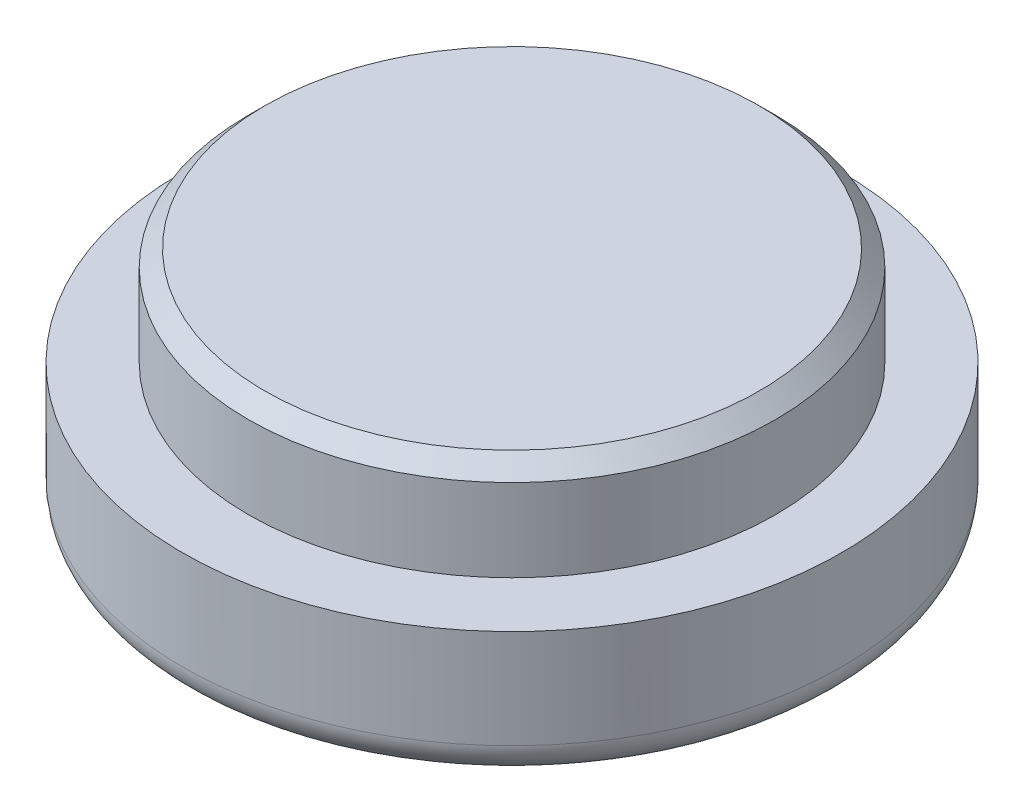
from build123d import *

# Parameters (mm, degrees)
CONG_1_R        = 1
CHANFREIN1_SIZE = 0.5


with BuildPart() as part:
    # Esquisse1 → R_volution1 (revolve)
    with BuildSketch(Plane.XY):
        Polygon((0, 3), (-8, 3), (-8, 0), (-10, 0), (-10, -4), (0, -4), align=None)
    revolve(axis=Axis((0, 16.377885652, 0), (0, -1, 0)))

    # Cong_1
    cong_1_edges = [part.edges().sort_by_distance(p)[0] for p in [
        (10, -4, 0),
    ]]
    fillet(cong_1_edges, radius=CONG_1_R)

    # Chanfrein1
    chanfrein1_edges = [part.edges().sort_by_distance(p)[0] for p in [
        (8, 3, 0),
    ]]
    chamfer(chanfrein1_edges, length=CHANFREIN1_SIZE)


solid = part.part
